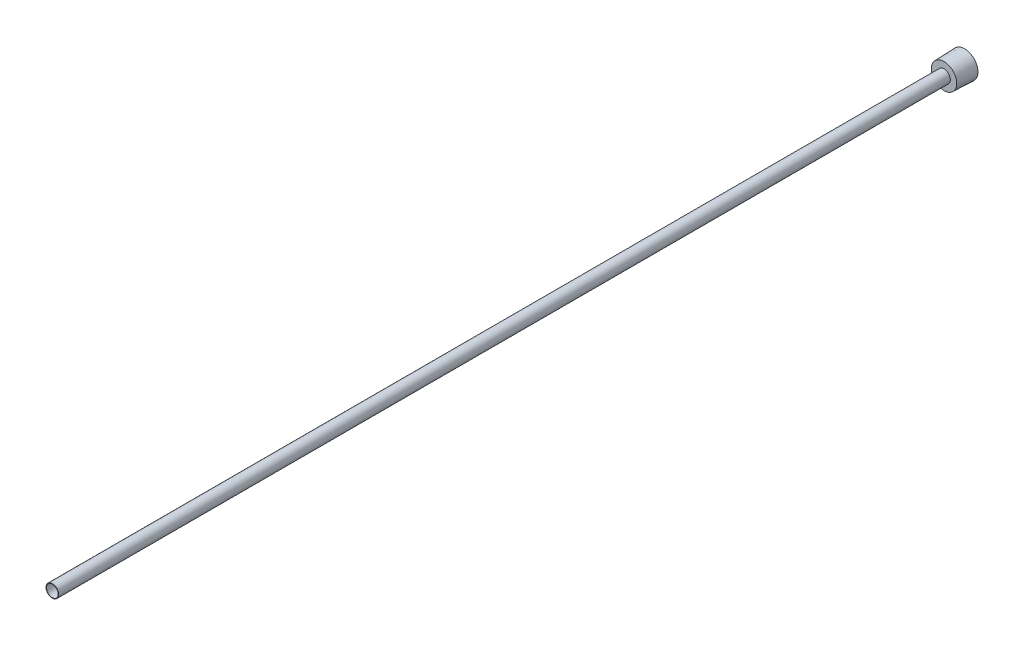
ISO-10303-21;
HEADER;
FILE_DESCRIPTION(('STEP AP214'),'2;1');
FILE_NAME('part.step','',(''),(''),'','','');
FILE_SCHEMA(('AUTOMOTIVE_DESIGN { 1 0 10303 214 1 1 1 1 }'));
ENDSEC;
DATA;
#1=APPLICATION_CONTEXT('core data for automotive mechanical design processes');
#2=APPLICATION_PROTOCOL_DEFINITION('international standard','automotive_design',2000,#1);
#3=PRODUCT_CONTEXT('',#1,'mechanical');
#4=PRODUCT('Part','Part','',(#3));
#5=PRODUCT_RELATED_PRODUCT_CATEGORY('part','',(#4));
#6=PRODUCT_DEFINITION_FORMATION('','',#4);
#7=PRODUCT_DEFINITION_CONTEXT('part definition',#1,'design');
#8=PRODUCT_DEFINITION('design','',#6,#7);
#9=PRODUCT_DEFINITION_SHAPE('','',#8);
#10=(LENGTH_UNIT() NAMED_UNIT(*) SI_UNIT(.MILLI.,.METRE.));
#11=(NAMED_UNIT(*) PLANE_ANGLE_UNIT() SI_UNIT($,.RADIAN.));
#12=(NAMED_UNIT(*) SI_UNIT($,.STERADIAN.) SOLID_ANGLE_UNIT());
#13=UNCERTAINTY_MEASURE_WITH_UNIT(LENGTH_MEASURE(1.E-05),#10,'distance_accuracy_value','');
#14=(GEOMETRIC_REPRESENTATION_CONTEXT(3) GLOBAL_UNCERTAINTY_ASSIGNED_CONTEXT((#13)) GLOBAL_UNIT_ASSIGNED_CONTEXT((#10,
#11,#12)) REPRESENTATION_CONTEXT('',''));
#15=CARTESIAN_POINT('',(0.,0.,0.));
#16=DIRECTION('',(0.,0.,1.));
#17=DIRECTION('',(1.,0.,0.));
#18=AXIS2_PLACEMENT_3D('',#15,#16,#17);
#19=CARTESIAN_POINT('',(0.,0.,0.));
#20=DIRECTION('',(0.,0.,1.));
#21=DIRECTION('',(1.,0.,0.));
#22=AXIS2_PLACEMENT_3D('',#19,#20,#21);
#23=CYLINDRICAL_SURFACE('',#22,2.921);
#24=CARTESIAN_POINT('',(0.,0.,457.2));
#25=DIRECTION('',(0.,0.,1.));
#26=DIRECTION('',(1.,0.,0.));
#27=AXIS2_PLACEMENT_3D('',#24,#25,#26);
#28=CIRCLE('',#27,2.921);
#29=CARTESIAN_POINT('',(2.921,0.,457.2));
#30=VERTEX_POINT('',#29);
#31=EDGE_CURVE('E142',#30,#30,#28,.T.);
#32=ORIENTED_EDGE('',*,*,#31,.T.);
#33=EDGE_LOOP('',(#32));
#34=FACE_BOUND('',#33,.T.);
#35=CARTESIAN_POINT('',(0.,0.,6.35));
#36=DIRECTION('',(0.,0.,-1.));
#37=DIRECTION('',(-1.,0.,0.));
#38=AXIS2_PLACEMENT_3D('',#35,#36,#37);
#39=CIRCLE('',#38,2.921);
#40=CARTESIAN_POINT('',(-2.921,0.,6.35));
#41=VERTEX_POINT('',#40);
#42=EDGE_CURVE('E37',#41,#41,#39,.F.);
#43=ORIENTED_EDGE('',*,*,#42,.F.);
#44=EDGE_LOOP('',(#43));
#45=FACE_BOUND('',#44,.T.);
#46=ADVANCED_FACE('F33',(#34,#45),#23,.F.);
#47=CARTESIAN_POINT('',(0.,0.,0.));
#48=DIRECTION('',(0.,0.,-1.));
#49=DIRECTION('',(-1.,0.,0.));
#50=AXIS2_PLACEMENT_3D('',#47,#48,#49);
#51=CONICAL_SURFACE('',#50,6.7183,0.0364599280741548);
#52=CARTESIAN_POINT('',(0.,0.,10.3124));
#53=DIRECTION('',(0.,0.,1.));
#54=DIRECTION('',(1.,0.,0.));
#55=AXIS2_PLACEMENT_3D('',#52,#53,#54);
#56=CIRCLE('',#55,6.34214394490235);
#57=CARTESIAN_POINT('',(6.34214394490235,0.,10.3124));
#58=VERTEX_POINT('',#57);
#59=EDGE_CURVE('E11',#58,#58,#56,.T.);
#60=ORIENTED_EDGE('',*,*,#59,.F.);
#61=EDGE_LOOP('',(#60));
#62=FACE_BOUND('',#61,.T.);
#63=CARTESIAN_POINT('',(0.,0.,0.));
#64=DIRECTION('',(0.,0.,1.));
#65=DIRECTION('',(1.,0.,0.));
#66=AXIS2_PLACEMENT_3D('',#63,#64,#65);
#67=CIRCLE('',#66,6.7183);
#68=CARTESIAN_POINT('',(6.7183,0.,0.));
#69=VERTEX_POINT('',#68);
#70=EDGE_CURVE('E145',#69,#69,#67,.T.);
#71=ORIENTED_EDGE('',*,*,#70,.T.);
#72=EDGE_LOOP('',(#71));
#73=FACE_BOUND('',#72,.T.);
#74=ADVANCED_FACE('F35',(#62,#73),#51,.T.);
#75=CARTESIAN_POINT('',(0.,6.34214394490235,10.3124));
#76=DIRECTION('',(0.,0.,-1.));
#77=DIRECTION('',(-1.,0.,0.));
#78=AXIS2_PLACEMENT_3D('',#75,#76,#77);
#79=PLANE('',#78);
#80=CARTESIAN_POINT('',(0.,0.,10.3124));
#81=DIRECTION('',(0.,0.,1.));
#82=DIRECTION('',(1.,0.,0.));
#83=AXIS2_PLACEMENT_3D('',#80,#81,#82);
#84=CIRCLE('',#83,3.175);
#85=CARTESIAN_POINT('',(3.175,0.,10.3124));
#86=VERTEX_POINT('',#85);
#87=EDGE_CURVE('E42',#86,#86,#84,.T.);
#88=ORIENTED_EDGE('',*,*,#87,.F.);
#89=EDGE_LOOP('',(#88));
#90=FACE_BOUND('',#89,.T.);
#91=ORIENTED_EDGE('',*,*,#59,.T.);
#92=EDGE_LOOP('',(#91));
#93=FACE_BOUND('',#92,.T.);
#94=ADVANCED_FACE('F156',(#90,#93),#79,.F.);
#95=CARTESIAN_POINT('',(0.,0.,331.124179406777));
#96=DIRECTION('',(0.,0.,1.));
#97=DIRECTION('',(1.,0.,0.));
#98=AXIS2_PLACEMENT_3D('',#95,#96,#97);
#99=CYLINDRICAL_SURFACE('',#98,3.17499999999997);
#100=CARTESIAN_POINT('',(0.,0.,457.2));
#101=DIRECTION('',(0.,0.,1.));
#102=DIRECTION('',(1.,0.,0.));
#103=AXIS2_PLACEMENT_3D('',#100,#101,#102);
#104=CIRCLE('',#103,3.17499999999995);
#105=CARTESIAN_POINT('',(3.17499999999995,0.,457.2));
#106=VERTEX_POINT('',#105);
#107=EDGE_CURVE('E148',#106,#106,#104,.T.);
#108=ORIENTED_EDGE('',*,*,#107,.F.);
#109=EDGE_LOOP('',(#108));
#110=FACE_BOUND('',#109,.T.);
#111=ORIENTED_EDGE('',*,*,#87,.T.);
#112=EDGE_LOOP('',(#111));
#113=FACE_BOUND('',#112,.T.);
#114=ADVANCED_FACE('F154',(#110,#113),#99,.T.);
#115=CARTESIAN_POINT('',(0.,3.17499999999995,457.2));
#116=DIRECTION('',(0.,0.,-1.));
#117=DIRECTION('',(-1.,0.,0.));
#118=AXIS2_PLACEMENT_3D('',#115,#116,#117);
#119=PLANE('',#118);
#120=ORIENTED_EDGE('',*,*,#31,.F.);
#121=EDGE_LOOP('',(#120));
#122=FACE_BOUND('',#121,.T.);
#123=ORIENTED_EDGE('',*,*,#107,.T.);
#124=EDGE_LOOP('',(#123));
#125=FACE_BOUND('',#124,.T.);
#126=ADVANCED_FACE('F167',(#122,#125),#119,.F.);
#127=CARTESIAN_POINT('',(0.,0.,0.));
#128=DIRECTION('',(0.,0.,1.));
#129=DIRECTION('',(1.,0.,0.));
#130=AXIS2_PLACEMENT_3D('',#127,#128,#129);
#131=PLANE('',#130);
#132=DIRECTION('',(-0.866025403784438,-0.5,0.));
#133=VECTOR('',#132,1.);
#134=CARTESIAN_POINT('',(3.175,-1.83308710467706,0.));
#135=LINE('',#134,#133);
#136=CARTESIAN_POINT('',(3.175,-1.83308710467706,0.));
#137=VERTEX_POINT('',#136);
#138=CARTESIAN_POINT('',(0.,-3.66617420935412,0.));
#139=VERTEX_POINT('',#138);
#140=EDGE_CURVE('E124',#137,#139,#135,.T.);
#141=ORIENTED_EDGE('',*,*,#140,.F.);
#142=DIRECTION('',(0.,-1.,0.));
#143=VECTOR('',#142,1.);
#144=CARTESIAN_POINT('',(3.175,1.83308710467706,0.));
#145=LINE('',#144,#143);
#146=CARTESIAN_POINT('',(3.175,1.83308710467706,0.));
#147=VERTEX_POINT('',#146);
#148=EDGE_CURVE('E49',#147,#137,#145,.T.);
#149=ORIENTED_EDGE('',*,*,#148,.F.);
#150=DIRECTION('',(0.866025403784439,-0.5,0.));
#151=VECTOR('',#150,1.);
#152=CARTESIAN_POINT('',(0.,3.66617420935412,0.));
#153=LINE('',#152,#151);
#154=CARTESIAN_POINT('',(0.,3.66617420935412,0.));
#155=VERTEX_POINT('',#154);
#156=EDGE_CURVE('E133',#155,#147,#153,.T.);
#157=ORIENTED_EDGE('',*,*,#156,.F.);
#158=DIRECTION('',(0.866025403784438,0.5,0.));
#159=VECTOR('',#158,1.);
#160=CARTESIAN_POINT('',(-3.175,1.83308710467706,0.));
#161=LINE('',#160,#159);
#162=CARTESIAN_POINT('',(-3.175,1.83308710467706,0.));
#163=VERTEX_POINT('',#162);
#164=EDGE_CURVE('E131',#163,#155,#161,.T.);
#165=ORIENTED_EDGE('',*,*,#164,.F.);
#166=DIRECTION('',(0.,1.,0.));
#167=VECTOR('',#166,1.);
#168=CARTESIAN_POINT('',(-3.175,-1.83308710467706,0.));
#169=LINE('',#168,#167);
#170=CARTESIAN_POINT('',(-3.175,-1.83308710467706,0.));
#171=VERTEX_POINT('',#170);
#172=EDGE_CURVE('E97',#171,#163,#169,.T.);
#173=ORIENTED_EDGE('',*,*,#172,.F.);
#174=DIRECTION('',(-0.866025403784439,0.5,0.));
#175=VECTOR('',#174,1.);
#176=CARTESIAN_POINT('',(0.,-3.66617420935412,0.));
#177=LINE('',#176,#175);
#178=EDGE_CURVE('E127',#139,#171,#177,.T.);
#179=ORIENTED_EDGE('',*,*,#178,.F.);
#180=EDGE_LOOP('',(#141,#149,#157,#165,#173,#179));
#181=FACE_BOUND('',#180,.T.);
#182=ORIENTED_EDGE('',*,*,#70,.F.);
#183=EDGE_LOOP('',(#182));
#184=FACE_BOUND('',#183,.T.);
#185=ADVANCED_FACE('F165',(#181,#184),#131,.F.);
#186=CARTESIAN_POINT('',(3.175,-1.83308710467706,6.35));
#187=DIRECTION('',(0.,0.,-1.));
#188=DIRECTION('',(-1.,0.,0.));
#189=AXIS2_PLACEMENT_3D('',#186,#187,#188);
#190=PLANE('',#189);
#191=DIRECTION('',(0.,-1.,0.));
#192=VECTOR('',#191,1.);
#193=CARTESIAN_POINT('',(3.175,1.83308710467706,6.35));
#194=LINE('',#193,#192);
#195=CARTESIAN_POINT('',(3.175,1.83308710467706,6.35));
#196=VERTEX_POINT('',#195);
#197=CARTESIAN_POINT('',(3.175,-1.83308710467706,6.35));
#198=VERTEX_POINT('',#197);
#199=EDGE_CURVE('E135',#196,#198,#194,.T.);
#200=ORIENTED_EDGE('',*,*,#199,.T.);
#201=DIRECTION('',(-0.866025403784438,-0.5,0.));
#202=VECTOR('',#201,1.);
#203=CARTESIAN_POINT('',(3.175,-1.83308710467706,6.35));
#204=LINE('',#203,#202);
#205=CARTESIAN_POINT('',(0.,-3.66617420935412,6.35));
#206=VERTEX_POINT('',#205);
#207=EDGE_CURVE('E118',#198,#206,#204,.T.);
#208=ORIENTED_EDGE('',*,*,#207,.T.);
#209=DIRECTION('',(-0.866025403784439,0.5,0.));
#210=VECTOR('',#209,1.);
#211=CARTESIAN_POINT('',(0.,-3.66617420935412,6.35));
#212=LINE('',#211,#210);
#213=CARTESIAN_POINT('',(-3.175,-1.83308710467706,6.35));
#214=VERTEX_POINT('',#213);
#215=EDGE_CURVE('E116',#206,#214,#212,.T.);
#216=ORIENTED_EDGE('',*,*,#215,.T.);
#217=DIRECTION('',(0.,1.,0.));
#218=VECTOR('',#217,1.);
#219=CARTESIAN_POINT('',(-3.175,-1.83308710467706,6.35));
#220=LINE('',#219,#218);
#221=CARTESIAN_POINT('',(-3.175,1.83308710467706,6.35));
#222=VERTEX_POINT('',#221);
#223=EDGE_CURVE('E94',#214,#222,#220,.T.);
#224=ORIENTED_EDGE('',*,*,#223,.T.);
#225=DIRECTION('',(0.866025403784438,0.5,0.));
#226=VECTOR('',#225,1.);
#227=CARTESIAN_POINT('',(-3.175,1.83308710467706,6.35));
#228=LINE('',#227,#226);
#229=CARTESIAN_POINT('',(0.,3.66617420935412,6.35));
#230=VERTEX_POINT('',#229);
#231=EDGE_CURVE('E105',#222,#230,#228,.T.);
#232=ORIENTED_EDGE('',*,*,#231,.T.);
#233=DIRECTION('',(0.866025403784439,-0.5,0.));
#234=VECTOR('',#233,1.);
#235=CARTESIAN_POINT('',(0.,3.66617420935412,6.35));
#236=LINE('',#235,#234);
#237=EDGE_CURVE('E109',#230,#196,#236,.T.);
#238=ORIENTED_EDGE('',*,*,#237,.T.);
#239=EDGE_LOOP('',(#200,#208,#216,#224,#232,#238));
#240=FACE_BOUND('',#239,.T.);
#241=ORIENTED_EDGE('',*,*,#42,.T.);
#242=EDGE_LOOP('',(#241));
#243=FACE_BOUND('',#242,.T.);
#244=ADVANCED_FACE('F112',(#240,#243),#190,.T.);
#245=CARTESIAN_POINT('',(3.175,1.83308710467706,6.35));
#246=DIRECTION('',(1.,0.,0.));
#247=DIRECTION('',(0.,1.,0.));
#248=AXIS2_PLACEMENT_3D('',#245,#246,#247);
#249=PLANE('',#248);
#250=ORIENTED_EDGE('',*,*,#148,.T.);
#251=DIRECTION('',(0.,0.,-1.));
#252=VECTOR('',#251,1.);
#253=CARTESIAN_POINT('',(3.175,-1.83308710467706,6.35));
#254=LINE('',#253,#252);
#255=EDGE_CURVE('E79',#198,#137,#254,.T.);
#256=ORIENTED_EDGE('',*,*,#255,.F.);
#257=ORIENTED_EDGE('',*,*,#199,.F.);
#258=DIRECTION('',(0.,0.,-1.));
#259=VECTOR('',#258,1.);
#260=CARTESIAN_POINT('',(3.175,1.83308710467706,6.35));
#261=LINE('',#260,#259);
#262=EDGE_CURVE('E57',#196,#147,#261,.T.);
#263=ORIENTED_EDGE('',*,*,#262,.T.);
#264=EDGE_LOOP('',(#250,#256,#257,#263));
#265=FACE_BOUND('',#264,.T.);
#266=ADVANCED_FACE('F174',(#265),#249,.F.);
#267=CARTESIAN_POINT('',(0.,3.66617420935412,6.35));
#268=DIRECTION('',(0.5,0.866025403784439,0.));
#269=DIRECTION('',(-0.866025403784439,0.5,0.));
#270=AXIS2_PLACEMENT_3D('',#267,#268,#269);
#271=PLANE('',#270);
#272=ORIENTED_EDGE('',*,*,#156,.T.);
#273=ORIENTED_EDGE('',*,*,#262,.F.);
#274=ORIENTED_EDGE('',*,*,#237,.F.);
#275=DIRECTION('',(0.,0.,-1.));
#276=VECTOR('',#275,1.);
#277=CARTESIAN_POINT('',(0.,3.66617420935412,6.35));
#278=LINE('',#277,#276);
#279=EDGE_CURVE('E101',#230,#155,#278,.T.);
#280=ORIENTED_EDGE('',*,*,#279,.T.);
#281=EDGE_LOOP('',(#272,#273,#274,#280));
#282=FACE_BOUND('',#281,.T.);
#283=ADVANCED_FACE('F188',(#282),#271,.F.);
#284=CARTESIAN_POINT('',(-3.175,1.83308710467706,6.35));
#285=DIRECTION('',(-0.5,0.866025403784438,0.));
#286=DIRECTION('',(-0.866025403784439,-0.5,0.));
#287=AXIS2_PLACEMENT_3D('',#284,#285,#286);
#288=PLANE('',#287);
#289=ORIENTED_EDGE('',*,*,#164,.T.);
#290=ORIENTED_EDGE('',*,*,#279,.F.);
#291=ORIENTED_EDGE('',*,*,#231,.F.);
#292=DIRECTION('',(0.,0.,-1.));
#293=VECTOR('',#292,1.);
#294=CARTESIAN_POINT('',(-3.175,1.83308710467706,6.35));
#295=LINE('',#294,#293);
#296=EDGE_CURVE('E90',#222,#163,#295,.T.);
#297=ORIENTED_EDGE('',*,*,#296,.T.);
#298=EDGE_LOOP('',(#289,#290,#291,#297));
#299=FACE_BOUND('',#298,.T.);
#300=ADVANCED_FACE('F106',(#299),#288,.F.);
#301=CARTESIAN_POINT('',(-3.175,-1.83308710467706,6.35));
#302=DIRECTION('',(-1.,0.,0.));
#303=DIRECTION('',(0.,0.,1.));
#304=AXIS2_PLACEMENT_3D('',#301,#302,#303);
#305=PLANE('',#304);
#306=ORIENTED_EDGE('',*,*,#172,.T.);
#307=ORIENTED_EDGE('',*,*,#296,.F.);
#308=ORIENTED_EDGE('',*,*,#223,.F.);
#309=DIRECTION('',(0.,0.,-1.));
#310=VECTOR('',#309,1.);
#311=CARTESIAN_POINT('',(-3.175,-1.83308710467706,6.35));
#312=LINE('',#311,#310);
#313=EDGE_CURVE('E102',#214,#171,#312,.T.);
#314=ORIENTED_EDGE('',*,*,#313,.T.);
#315=EDGE_LOOP('',(#306,#307,#308,#314));
#316=FACE_BOUND('',#315,.T.);
#317=ADVANCED_FACE('F92',(#316),#305,.F.);
#318=CARTESIAN_POINT('',(0.,-3.66617420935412,6.35));
#319=DIRECTION('',(-0.5,-0.866025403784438,0.));
#320=DIRECTION('',(0.866025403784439,-0.5,0.));
#321=AXIS2_PLACEMENT_3D('',#318,#319,#320);
#322=PLANE('',#321);
#323=ORIENTED_EDGE('',*,*,#178,.T.);
#324=ORIENTED_EDGE('',*,*,#313,.F.);
#325=ORIENTED_EDGE('',*,*,#215,.F.);
#326=DIRECTION('',(0.,0.,-1.));
#327=VECTOR('',#326,1.);
#328=CARTESIAN_POINT('',(0.,-3.66617420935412,6.35));
#329=LINE('',#328,#327);
#330=EDGE_CURVE('E139',#206,#139,#329,.T.);
#331=ORIENTED_EDGE('',*,*,#330,.T.);
#332=EDGE_LOOP('',(#323,#324,#325,#331));
#333=FACE_BOUND('',#332,.T.);
#334=ADVANCED_FACE('F192',(#333),#322,.F.);
#335=CARTESIAN_POINT('',(3.175,-1.83308710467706,6.35));
#336=DIRECTION('',(0.5,-0.866025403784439,0.));
#337=DIRECTION('',(0.866025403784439,0.5,0.));
#338=AXIS2_PLACEMENT_3D('',#335,#336,#337);
#339=PLANE('',#338);
#340=ORIENTED_EDGE('',*,*,#140,.T.);
#341=ORIENTED_EDGE('',*,*,#330,.F.);
#342=ORIENTED_EDGE('',*,*,#207,.F.);
#343=ORIENTED_EDGE('',*,*,#255,.T.);
#344=EDGE_LOOP('',(#340,#341,#342,#343));
#345=FACE_BOUND('',#344,.T.);
#346=ADVANCED_FACE('F189',(#345),#339,.F.);
#347=CLOSED_SHELL('',(#46,#74,#94,#114,#126,#185,#244,#266,#283,#300,#317,#334,#346));
#348=MANIFOLD_SOLID_BREP('B2',#347);
#349=ADVANCED_BREP_SHAPE_REPRESENTATION('',(#18,#348),#14);
#350=SHAPE_DEFINITION_REPRESENTATION(#9,#349);
ENDSEC;
END-ISO-10303-21;
